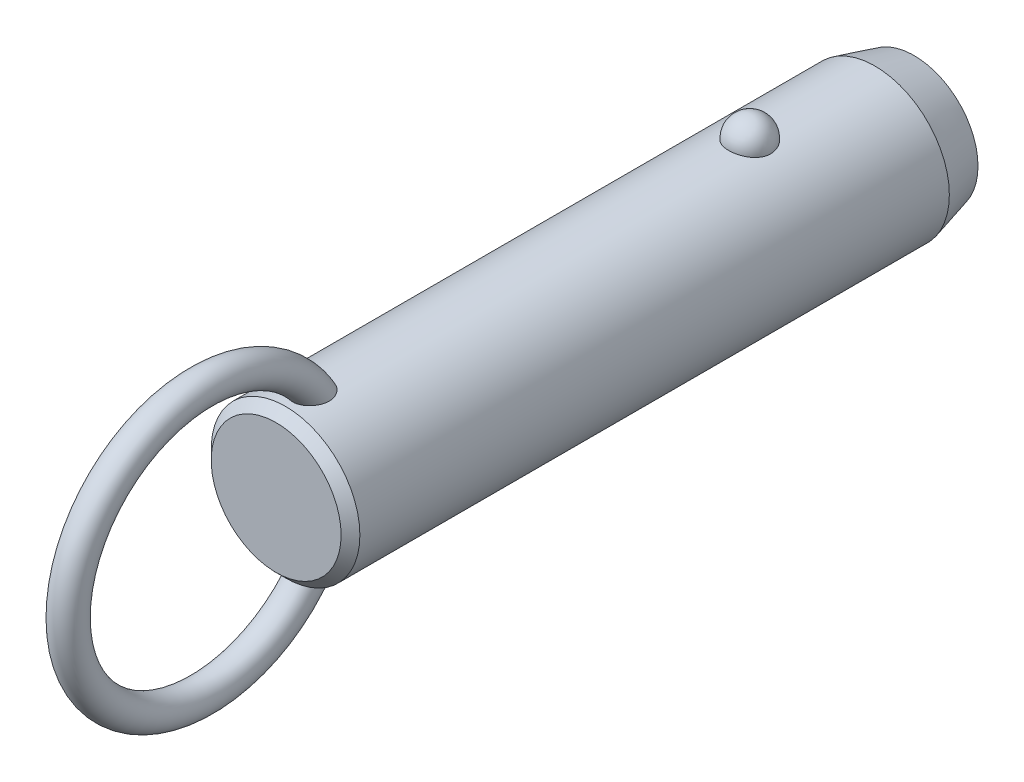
ISO-10303-21;
HEADER;
FILE_DESCRIPTION(('STEP AP214'),'2;1');
FILE_NAME('part.step','',(''),(''),'','','');
FILE_SCHEMA(('AUTOMOTIVE_DESIGN { 1 0 10303 214 1 1 1 1 }'));
ENDSEC;
DATA;
#1=APPLICATION_CONTEXT('core data for automotive mechanical design processes');
#2=APPLICATION_PROTOCOL_DEFINITION('international standard','automotive_design',2000,#1);
#3=PRODUCT_CONTEXT('',#1,'mechanical');
#4=PRODUCT('Part','Part','',(#3));
#5=PRODUCT_RELATED_PRODUCT_CATEGORY('part','',(#4));
#6=PRODUCT_DEFINITION_FORMATION('','',#4);
#7=PRODUCT_DEFINITION_CONTEXT('part definition',#1,'design');
#8=PRODUCT_DEFINITION('design','',#6,#7);
#9=PRODUCT_DEFINITION_SHAPE('','',#8);
#10=(LENGTH_UNIT() NAMED_UNIT(*) SI_UNIT(.MILLI.,.METRE.));
#11=(NAMED_UNIT(*) PLANE_ANGLE_UNIT() SI_UNIT($,.RADIAN.));
#12=(NAMED_UNIT(*) SI_UNIT($,.STERADIAN.) SOLID_ANGLE_UNIT());
#13=UNCERTAINTY_MEASURE_WITH_UNIT(LENGTH_MEASURE(1.E-05),#10,'distance_accuracy_value','');
#14=(GEOMETRIC_REPRESENTATION_CONTEXT(3) GLOBAL_UNCERTAINTY_ASSIGNED_CONTEXT((#13)) GLOBAL_UNIT_ASSIGNED_CONTEXT((#10,
#11,#12)) REPRESENTATION_CONTEXT('',''));
#15=CARTESIAN_POINT('',(0.,0.,0.));
#16=DIRECTION('',(0.,0.,1.));
#17=DIRECTION('',(1.,0.,0.));
#18=AXIS2_PLACEMENT_3D('',#15,#16,#17);
#19=CARTESIAN_POINT('',(0.,0.,48.3));
#20=DIRECTION('',(0.,0.,-1.));
#21=DIRECTION('',(-1.,0.,0.));
#22=AXIS2_PLACEMENT_3D('',#19,#20,#21);
#23=CYLINDRICAL_SURFACE('',#22,9.5);
#24=CARTESIAN_POINT('',(2.67259918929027,9.11631578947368,-2.7));
#25=CARTESIAN_POINT('',(2.6725968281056,9.11631786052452,-2.54909854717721));
#26=CARTESIAN_POINT('',(2.66030567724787,9.11994722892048,-2.39816735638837));
#27=CARTESIAN_POINT('',(2.6114347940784,9.13405924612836,-2.10058568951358));
#28=CARTESIAN_POINT('',(2.57484658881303,9.14454428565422,-1.95393672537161));
#29=CARTESIAN_POINT('',(2.47830875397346,9.17117631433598,-1.66916069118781));
#30=CARTESIAN_POINT('',(2.41836936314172,9.18732082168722,-1.53102991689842));
#31=CARTESIAN_POINT('',(2.27661331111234,9.22346780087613,-1.26705393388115));
#32=CARTESIAN_POINT('',(2.19479699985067,9.24347021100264,-1.14120852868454));
#33=CARTESIAN_POINT('',(2.01085282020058,9.28522401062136,-0.904632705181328));
#34=CARTESIAN_POINT('',(1.90862396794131,9.30698376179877,-0.793982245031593));
#35=CARTESIAN_POINT('',(1.6867437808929,9.34973971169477,-0.591607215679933));
#36=CARTESIAN_POINT('',(1.56709244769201,9.37073591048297,-0.49988264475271));
#37=CARTESIAN_POINT('',(1.31393976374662,9.40956370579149,-0.338167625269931));
#38=CARTESIAN_POINT('',(1.18048026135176,9.42740444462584,-0.268113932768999));
#39=CARTESIAN_POINT('',(0.903154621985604,9.45799906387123,-0.151390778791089));
#40=CARTESIAN_POINT('',(0.759289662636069,9.47075351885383,-0.104718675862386));
#41=CARTESIAN_POINT('',(0.468074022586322,9.48956256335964,-0.0367633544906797));
#42=CARTESIAN_POINT('',(0.320836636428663,9.49573643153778,-0.015027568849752));
#43=CARTESIAN_POINT('',(0.0246714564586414,9.50112183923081,0.00396199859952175));
#44=CARTESIAN_POINT('',(-0.124256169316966,9.50033406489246,0.00121819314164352));
#45=CARTESIAN_POINT('',(-0.417264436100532,9.4919475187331,-0.0284441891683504));
#46=CARTESIAN_POINT('',(-0.56138413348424,9.48444885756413,-0.0550074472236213));
#47=CARTESIAN_POINT('',(-0.842986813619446,9.46357853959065,-0.131064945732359));
#48=CARTESIAN_POINT('',(-0.980469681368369,9.450206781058,-0.180559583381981));
#49=CARTESIAN_POINT('',(-1.24585005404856,9.41890822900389,-0.301476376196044));
#50=CARTESIAN_POINT('',(-1.37368611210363,9.40095498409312,-0.373026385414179));
#51=CARTESIAN_POINT('',(-1.61552738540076,9.3624296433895,-0.536025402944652));
#52=CARTESIAN_POINT('',(-1.72953116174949,9.34185727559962,-0.627476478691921));
#53=CARTESIAN_POINT('',(-1.9429225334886,9.29984568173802,-0.829844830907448));
#54=CARTESIAN_POINT('',(-2.04198021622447,9.27839736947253,-0.941108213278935));
#55=CARTESIAN_POINT('',(-2.2202646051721,9.23735994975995,-1.17883414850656));
#56=CARTESIAN_POINT('',(-2.29948985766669,9.21777097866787,-1.30529781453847));
#57=CARTESIAN_POINT('',(-2.43697287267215,9.18238994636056,-1.57158566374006));
#58=CARTESIAN_POINT('',(-2.49497068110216,9.16664569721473,-1.71155057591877));
#59=CARTESIAN_POINT('',(-2.5872073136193,9.14104303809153,-1.99961197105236));
#60=CARTESIAN_POINT('',(-2.62144683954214,9.13118445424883,-2.14770821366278));
#61=CARTESIAN_POINT('',(-2.66521466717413,9.11850622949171,-2.44715424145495));
#62=CARTESIAN_POINT('',(-2.67484831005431,9.11565658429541,-2.59848735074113));
#63=CARTESIAN_POINT('',(-2.66946735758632,9.11723375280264,-2.90067317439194));
#64=CARTESIAN_POINT('',(-2.65445345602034,9.12166036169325,-3.05152590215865));
#65=CARTESIAN_POINT('',(-2.60029711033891,9.13724422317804,-3.34766110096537));
#66=CARTESIAN_POINT('',(-2.56127978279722,9.14836656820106,-3.49296833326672));
#67=CARTESIAN_POINT('',(-2.46018844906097,9.17606676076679,-3.77477535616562));
#68=CARTESIAN_POINT('',(-2.39811349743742,9.1926448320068,-3.9112747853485));
#69=CARTESIAN_POINT('',(-2.25202303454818,9.22952198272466,-4.17244273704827));
#70=CARTESIAN_POINT('',(-2.16788714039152,9.24984129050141,-4.29704106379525));
#71=CARTESIAN_POINT('',(-1.9799408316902,9.29188255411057,-4.53013066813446));
#72=CARTESIAN_POINT('',(-1.87612963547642,9.31360456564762,-4.63862130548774));
#73=CARTESIAN_POINT('',(-1.65105429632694,9.35612959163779,-4.8369029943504));
#74=CARTESIAN_POINT('',(-1.52972405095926,9.37692871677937,-4.92661991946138));
#75=CARTESIAN_POINT('',(-1.27318250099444,9.41518970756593,-5.08429106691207));
#76=CARTESIAN_POINT('',(-1.13797219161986,9.432651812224,-5.15224684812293));
#77=CARTESIAN_POINT('',(-0.859280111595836,9.46208255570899,-5.26371827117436));
#78=CARTESIAN_POINT('',(-0.715925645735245,9.47411833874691,-5.30753421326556));
#79=CARTESIAN_POINT('',(-0.423550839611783,9.4916822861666,-5.37076321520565));
#80=CARTESIAN_POINT('',(-0.274531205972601,9.49721125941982,-5.39017930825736));
#81=CARTESIAN_POINT('',(0.0218446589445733,9.50110860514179,-5.40390587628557));
#82=CARTESIAN_POINT('',(0.169177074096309,9.49961381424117,-5.39869609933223));
#83=CARTESIAN_POINT('',(0.460808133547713,9.48993906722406,-5.36441955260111));
#84=CARTESIAN_POINT('',(0.605106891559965,9.48175936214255,-5.33535367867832));
#85=CARTESIAN_POINT('',(0.886027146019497,9.4596376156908,-5.25435587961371));
#86=CARTESIAN_POINT('',(1.02267710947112,9.44571881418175,-5.20251612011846));
#87=CARTESIAN_POINT('',(1.28523827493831,9.41358993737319,-5.07741549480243));
#88=CARTESIAN_POINT('',(1.41114877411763,9.39537958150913,-5.00415322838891));
#89=CARTESIAN_POINT('',(1.65085227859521,9.3562644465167,-4.83684599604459));
#90=CARTESIAN_POINT('',(1.76442346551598,9.33532178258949,-4.74249218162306));
#91=CARTESIAN_POINT('',(1.97425672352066,9.29321198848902,-4.53620389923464));
#92=CARTESIAN_POINT('',(2.07051582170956,9.27204482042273,-4.42426641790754));
#93=CARTESIAN_POINT('',(2.24490086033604,9.23139221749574,-4.18363183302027));
#94=CARTESIAN_POINT('',(2.32267019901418,9.21194380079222,-4.05466990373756));
#95=CARTESIAN_POINT('',(2.45584092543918,9.1773419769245,-3.78517836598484));
#96=CARTESIAN_POINT('',(2.5112497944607,9.16218713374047,-3.64465264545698));
#97=CARTESIAN_POINT('',(2.59380876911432,9.13913522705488,-3.37104301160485));
#98=CARTESIAN_POINT('',(2.62330266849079,9.13064624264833,-3.23871053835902));
#99=CARTESIAN_POINT('',(2.66269870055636,9.11923566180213,-2.97092664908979));
#100=CARTESIAN_POINT('',(2.67260130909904,9.11631393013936,-2.83547530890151));
#101=CARTESIAN_POINT('',(2.67259918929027,9.11631578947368,-2.7));
#102=B_SPLINE_CURVE_WITH_KNOTS('',3,(#24,#25,#26,#27,#28,#29,#30,#31,#32,#33,#34,#35,#36,#37,
#38,#39,#40,#41,#42,#43,#44,#45,#46,#47,#48,#49,#50,#51,#52,#53,#54,#55,#56,#57,#58,#59,#60,#61,
#62,#63,#64,#65,#66,#67,#68,#69,#70,#71,#72,#73,#74,#75,#76,#77,#78,#79,#80,#81,#82,#83,#84,#85,
#86,#87,#88,#89,#90,#91,#92,#93,#94,#95,#96,#97,#98,#99,#100,#101),.UNSPECIFIED.,.T.,.F.,(4,2,2,
2,2,2,2,2,2,2,2,2,2,2,2,2,2,2,2,2,2,2,2,2,2,2,2,2,2,2,2,2,2,2,2,2,2,2,4),(0.,0.452217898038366,
0.904593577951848,1.35677112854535,1.80894144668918,2.26340676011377,2.71787203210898,
3.17099820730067,3.62407318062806,4.0687883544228,4.51345969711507,4.95160616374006,
5.38976021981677,5.83050358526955,6.27129275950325,6.72071308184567,7.17016633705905,
7.62495278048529,8.07972578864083,8.53254856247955,8.98535859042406,9.43582813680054,
9.88631615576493,10.3393155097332,10.7923328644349,11.2471065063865,11.7018475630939,
12.150795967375,12.599688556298,13.0398725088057,13.4800399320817,13.9184421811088,
14.3568730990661,14.802202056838,15.2476074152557,15.7010097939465,16.1542603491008,
16.5602594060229,16.966248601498),.UNSPECIFIED.);
#103=CARTESIAN_POINT('',(2.67259918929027,9.11631578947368,-2.7));
#104=VERTEX_POINT('',#103);
#105=EDGE_CURVE('E41',#104,#104,#102,.T.);
#106=ORIENTED_EDGE('',*,*,#105,.T.);
#107=EDGE_LOOP('',(#106));
#108=FACE_BOUND('',#107,.T.);
#109=CARTESIAN_POINT('',(0.,0.,56.62));
#110=DIRECTION('',(0.,0.,1.));
#111=DIRECTION('',(1.,0.,0.));
#112=AXIS2_PLACEMENT_3D('',#109,#110,#111);
#113=CIRCLE('',#112,9.5);
#114=CARTESIAN_POINT('',(9.5,0.,56.62));
#115=VERTEX_POINT('',#114);
#116=EDGE_CURVE('E10',#115,#115,#113,.F.);
#117=ORIENTED_EDGE('',*,*,#116,.T.);
#118=EDGE_LOOP('',(#117));
#119=FACE_BOUND('',#118,.T.);
#120=CARTESIAN_POINT('',(-0.697062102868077,-9.47439269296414,50.9678088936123));
#121=CARTESIAN_POINT('',(-0.799579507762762,-9.46685146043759,51.0074823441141));
#122=CARTESIAN_POINT('',(-0.898575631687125,-9.45788043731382,51.0559309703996));
#123=CARTESIAN_POINT('',(-1.08670047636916,-9.43811593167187,51.1688685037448));
#124=CARTESIAN_POINT('',(-1.17583204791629,-9.42732297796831,51.2333527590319));
#125=CARTESIAN_POINT('',(-1.34179806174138,-9.40513672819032,51.3762099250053));
#126=CARTESIAN_POINT('',(-1.41865133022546,-9.39374438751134,51.454561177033));
#127=CARTESIAN_POINT('',(-1.5586004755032,-9.37154196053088,51.6227524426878));
#128=CARTESIAN_POINT('',(-1.62169476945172,-9.3607319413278,51.7125937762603));
#129=CARTESIAN_POINT('',(-1.73527695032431,-9.34035749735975,51.9045001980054));
#130=CARTESIAN_POINT('',(-1.7852226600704,-9.33085270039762,52.0068910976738));
#131=CARTESIAN_POINT('',(-1.86924997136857,-9.3143834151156,52.218148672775));
#132=CARTESIAN_POINT('',(-1.90332570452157,-9.30741986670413,52.3270177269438));
#133=CARTESIAN_POINT('',(-1.95893603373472,-9.29588482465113,52.5604730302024));
#134=CARTESIAN_POINT('',(-1.97872420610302,-9.29165182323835,52.6854890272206));
#135=CARTESIAN_POINT('',(-2.00062129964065,-9.28695978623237,52.9370805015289));
#136=CARTESIAN_POINT('',(-2.00272284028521,-9.28650232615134,53.063656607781));
#137=CARTESIAN_POINT('',(-1.98958876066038,-9.28932750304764,53.3368157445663));
#138=CARTESIAN_POINT('',(-1.97143366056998,-9.2932400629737,53.4832519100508));
#139=CARTESIAN_POINT('',(-1.91479925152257,-9.30507151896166,53.7720629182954));
#140=CARTESIAN_POINT('',(-1.87629122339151,-9.31299607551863,53.914431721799));
#141=CARTESIAN_POINT('',(-1.77225683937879,-9.33340232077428,54.2151725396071));
#142=CARTESIAN_POINT('',(-1.70334898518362,-9.34641636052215,54.3723691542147));
#143=CARTESIAN_POINT('',(-1.58111062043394,-9.36759153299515,54.5975171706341));
#144=CARTESIAN_POINT('',(-1.53721459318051,-9.37492619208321,54.6707968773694));
#145=CARTESIAN_POINT('',(-1.44302631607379,-9.38988566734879,54.8130740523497));
#146=CARTESIAN_POINT('',(-1.39273721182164,-9.39751033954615,54.8820736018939));
#147=CARTESIAN_POINT('',(-1.26775962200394,-9.41530678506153,55.0369832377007));
#148=CARTESIAN_POINT('',(-1.19052326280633,-9.42548108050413,55.1208712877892));
#149=CARTESIAN_POINT('',(-1.0242024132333,-9.44499825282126,55.2760086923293));
#150=CARTESIAN_POINT('',(-0.935139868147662,-9.45434261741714,55.3472808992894));
#151=CARTESIAN_POINT('',(-0.766610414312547,-9.46930670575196,55.4586955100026));
#152=CARTESIAN_POINT('',(-0.689439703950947,-9.47529223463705,55.5022354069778));
#153=CARTESIAN_POINT('',(-0.528942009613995,-9.48560294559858,55.5763133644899));
#154=CARTESIAN_POINT('',(-0.445620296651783,-9.48992953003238,55.6068624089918));
#155=CARTESIAN_POINT('',(-0.273901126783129,-9.49644161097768,55.6525792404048));
#156=CARTESIAN_POINT('',(-0.185465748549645,-9.49860811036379,55.66761059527));
#157=CARTESIAN_POINT('',(-0.00734541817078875,-9.5004135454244,55.6801494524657));
#158=CARTESIAN_POINT('',(0.0823387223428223,-9.50005405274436,55.6776678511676));
#159=CARTESIAN_POINT('',(0.247679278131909,-9.49708301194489,55.6569959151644));
#160=CARTESIAN_POINT('',(0.323620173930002,-9.49477609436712,55.6409300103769));
#161=CARTESIAN_POINT('',(0.471981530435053,-9.48855917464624,55.5971726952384));
#162=CARTESIAN_POINT('',(0.544400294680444,-9.48464840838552,55.5694757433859));
#163=CARTESIAN_POINT('',(0.708947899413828,-9.47398336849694,55.4928026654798));
#164=CARTESIAN_POINT('',(0.799149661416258,-9.46671310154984,55.4397745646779));
#165=CARTESIAN_POINT('',(0.969783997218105,-9.4507622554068,55.3199731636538));
#166=CARTESIAN_POINT('',(1.05019415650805,-9.44207854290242,55.2531692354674));
#167=CARTESIAN_POINT('',(1.23092343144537,-9.42051459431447,55.0807596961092));
#168=CARTESIAN_POINT('',(1.32652499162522,-9.40733378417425,54.9702619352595));
#169=CARTESIAN_POINT('',(1.49893121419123,-9.38140745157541,54.7355614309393));
#170=CARTESIAN_POINT('',(1.57571616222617,-9.36866239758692,54.6113445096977));
#171=CARTESIAN_POINT('',(1.71285426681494,-9.34457644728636,54.3493891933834));
#172=CARTESIAN_POINT('',(1.77266365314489,-9.33328726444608,54.2113623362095));
#173=CARTESIAN_POINT('',(1.87239208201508,-9.31379209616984,53.9280515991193));
#174=CARTESIAN_POINT('',(1.91230158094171,-9.3055875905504,53.782764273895));
#175=CARTESIAN_POINT('',(1.9760418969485,-9.29228394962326,53.4620281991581));
#176=CARTESIAN_POINT('',(1.99587438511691,-9.28797202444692,53.2857248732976));
#177=CARTESIAN_POINT('',(2.0029570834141,-9.28645519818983,52.9324146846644));
#178=CARTESIAN_POINT('',(1.99025930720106,-9.28923895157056,52.7554093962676));
#179=CARTESIAN_POINT('',(1.93735479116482,-9.30038134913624,52.4563381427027));
#180=CARTESIAN_POINT('',(1.90576827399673,-9.30697680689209,52.3326679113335));
#181=CARTESIAN_POINT('',(1.82287484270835,-9.32356855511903,52.0923297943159));
#182=CARTESIAN_POINT('',(1.77158213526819,-9.33356239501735,51.9756569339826));
#183=CARTESIAN_POINT('',(1.64885744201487,-9.35602275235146,51.7527061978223));
#184=CARTESIAN_POINT('',(1.57730995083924,-9.36850332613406,51.6464927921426));
#185=CARTESIAN_POINT('',(1.41543264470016,-9.39431873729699,51.4495530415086));
#186=CARTESIAN_POINT('',(1.32510883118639,-9.40765330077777,51.3588217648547));
#187=CARTESIAN_POINT('',(1.13846223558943,-9.43195720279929,51.2050334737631));
#188=CARTESIAN_POINT('',(1.04369890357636,-9.44302894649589,51.1400947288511));
#189=CARTESIAN_POINT('',(0.843965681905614,-9.46296805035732,51.0280388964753));
#190=CARTESIAN_POINT('',(0.739000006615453,-9.4718363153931,50.9809144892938));
#191=CARTESIAN_POINT('',(0.528175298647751,-9.48586140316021,50.9081173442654));
#192=CARTESIAN_POINT('',(0.422686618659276,-9.49119633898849,50.8814024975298));
#193=CARTESIAN_POINT('',(0.208590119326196,-9.49831365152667,50.8460137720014));
#194=CARTESIAN_POINT('',(0.0999817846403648,-9.500095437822,50.8373428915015));
#195=CARTESIAN_POINT('',(-0.12610480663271,-9.49988861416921,50.8383501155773));
#196=CARTESIAN_POINT('',(-0.243578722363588,-9.49757821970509,50.8495942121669));
#197=CARTESIAN_POINT('',(-0.474390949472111,-9.48885165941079,50.893167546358));
#198=CARTESIAN_POINT('',(-0.587729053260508,-9.48243528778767,50.9254978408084));
#199=CARTESIAN_POINT('',(-0.697062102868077,-9.47439269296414,50.9678088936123));
#200=B_SPLINE_CURVE_WITH_KNOTS('',3,(#120,#121,#122,#123,#124,#125,#126,#127,#128,#129,#130,
#131,#132,#133,#134,#135,#136,#137,#138,#139,#140,#141,#142,#143,#144,#145,#146,#147,#148,#149,
#150,#151,#152,#153,#154,#155,#156,#157,#158,#159,#160,#161,#162,#163,#164,#165,#166,#167,#168,
#169,#170,#171,#172,#173,#174,#175,#176,#177,#178,#179,#180,#181,#182,#183,#184,#185,#186,#187,
#188,#189,#190,#191,#192,#193,#194,#195,#196,#197,#198,#199),.UNSPECIFIED.,.T.,.F.,(4,2,2,2,2,2,
2,2,2,2,2,2,2,2,2,2,2,2,2,2,2,2,2,2,2,2,2,2,2,2,2,2,2,2,2,2,2,2,2,4),(0.,0.330119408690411,
0.660143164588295,0.989655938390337,1.31920659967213,1.66074728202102,2.00241415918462,
2.38088696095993,2.75951768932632,3.20065679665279,3.6424200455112,4.15620996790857,
4.41314162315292,4.66994734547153,5.01228664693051,5.35399933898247,5.61943037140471,
5.88463652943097,6.15215502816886,6.41950709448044,6.65144391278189,6.88349136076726,
7.19641200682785,7.51003602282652,7.94779711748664,8.38601491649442,8.83699707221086,
9.28819530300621,9.81778662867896,10.3465317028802,10.7284172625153,11.1100280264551,
11.4938603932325,11.8775702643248,12.2220189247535,12.5663259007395,12.8915939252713,
13.2169159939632,13.5689650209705,13.9210316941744),.UNSPECIFIED.);
#201=CARTESIAN_POINT('',(-0.697062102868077,-9.47439269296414,50.9678088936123));
#202=VERTEX_POINT('',#201);
#203=EDGE_CURVE('E59',#202,#202,#200,.T.);
#204=ORIENTED_EDGE('',*,*,#203,.T.);
#205=EDGE_LOOP('',(#204));
#206=FACE_BOUND('',#205,.T.);
#207=CARTESIAN_POINT('',(-0.697062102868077,9.47439269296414,50.9678088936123));
#208=CARTESIAN_POINT('',(-0.597792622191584,9.48169483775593,50.9293956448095));
#209=CARTESIAN_POINT('',(-0.495106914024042,9.48766580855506,50.8991682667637));
#210=CARTESIAN_POINT('',(-0.285876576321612,9.49627648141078,50.8560327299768));
#211=CARTESIAN_POINT('',(-0.179324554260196,9.49890941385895,50.8431597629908));
#212=CARTESIAN_POINT('',(0.0344157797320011,9.50053798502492,50.8351666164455));
#213=CARTESIAN_POINT('',(0.141603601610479,9.49953613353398,50.8400341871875));
#214=CARTESIAN_POINT('',(0.353563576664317,9.49401038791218,50.8673654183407));
#215=CARTESIAN_POINT('',(0.458336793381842,9.48948807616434,50.88982117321));
#216=CARTESIAN_POINT('',(0.662493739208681,9.4774236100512,50.9516719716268));
#217=CARTESIAN_POINT('',(0.761881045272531,9.46988348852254,50.9910556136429));
#218=CARTESIAN_POINT('',(0.952608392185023,9.45260382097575,51.0856342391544));
#219=CARTESIAN_POINT('',(1.04394806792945,9.44286417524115,51.1408299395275));
#220=CARTESIAN_POINT('',(1.21712767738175,9.4221176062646,51.2660662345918));
#221=CARTESIAN_POINT('',(1.29885671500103,9.41109835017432,51.3362579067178));
#222=CARTESIAN_POINT('',(1.4497897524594,9.38903310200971,51.488980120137));
#223=CARTESIAN_POINT('',(1.51899278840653,9.37798710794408,51.5715116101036));
#224=CARTESIAN_POINT('',(1.64602857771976,9.35654375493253,51.7497763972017));
#225=CARTESIAN_POINT('',(1.70333052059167,9.34618688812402,51.8458916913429));
#226=CARTESIAN_POINT('',(1.80259341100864,9.32755128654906,52.045897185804));
#227=CARTESIAN_POINT('',(1.84454942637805,9.31927322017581,52.1497898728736));
#228=CARTESIAN_POINT('',(1.91637039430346,9.30478365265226,52.3722131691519));
#229=CARTESIAN_POINT('',(1.944805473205,9.29882552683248,52.4912192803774));
#230=CARTESIAN_POINT('',(1.98449865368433,9.29043398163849,52.7321436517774));
#231=CARTESIAN_POINT('',(1.99574908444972,9.28800213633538,52.8540631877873));
#232=CARTESIAN_POINT('',(2.00275141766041,9.28649645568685,53.1169324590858));
#233=CARTESIAN_POINT('',(1.99588238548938,9.28799035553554,53.2579529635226));
#234=CARTESIAN_POINT('',(1.96270559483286,9.29505517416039,53.5376217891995));
#235=CARTESIAN_POINT('',(1.93637872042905,9.30063010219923,53.676267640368));
#236=CARTESIAN_POINT('',(1.85949176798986,9.31633564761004,53.9725616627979));
#237=CARTESIAN_POINT('',(1.80549792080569,9.3270926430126,54.1292907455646));
#238=CARTESIAN_POINT('',(1.67376869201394,9.3516306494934,54.4322840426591));
#239=CARTESIAN_POINT('',(1.59603181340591,9.36541185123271,54.5785475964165));
#240=CARTESIAN_POINT('',(1.4360277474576,9.39110706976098,54.8258138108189));
#241=CARTESIAN_POINT('',(1.35831795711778,9.40278656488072,54.929791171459));
#242=CARTESIAN_POINT('',(1.18774483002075,9.42585025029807,55.1245347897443));
#243=CARTESIAN_POINT('',(1.09490932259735,9.43723493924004,55.2153247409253));
#244=CARTESIAN_POINT('',(0.921110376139,9.45552616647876,55.3562033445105));
#245=CARTESIAN_POINT('',(0.843738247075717,9.46281058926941,55.4106563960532));
#246=CARTESIAN_POINT('',(0.681245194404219,9.47589120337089,55.5067117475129));
#247=CARTESIAN_POINT('',(0.596135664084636,9.48168953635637,55.5483325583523));
#248=CARTESIAN_POINT('',(0.433779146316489,9.49038144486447,55.6100899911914));
#249=CARTESIAN_POINT('',(0.357459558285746,9.49359170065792,55.6326013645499));
#250=CARTESIAN_POINT('',(0.202074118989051,9.49816761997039,55.6645745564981));
#251=CARTESIAN_POINT('',(0.12301025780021,9.49953459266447,55.6740456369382));
#252=CARTESIAN_POINT('',(-0.0357372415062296,9.50026497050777,55.6791143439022));
#253=CARTESIAN_POINT('',(-0.115421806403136,9.49962433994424,55.6746840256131));
#254=CARTESIAN_POINT('',(-0.272823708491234,9.49640854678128,55.6522962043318));
#255=CARTESIAN_POINT('',(-0.350540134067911,9.4938325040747,55.6343325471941));
#256=CARTESIAN_POINT('',(-0.500580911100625,9.4870946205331,55.5868028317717));
#257=CARTESIAN_POINT('',(-0.57297929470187,9.48296359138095,55.5574618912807));
#258=CARTESIAN_POINT('',(-0.712864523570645,9.47347609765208,55.4890087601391));
#259=CARTESIAN_POINT('',(-0.7803490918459,9.46811906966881,55.4498920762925));
#260=CARTESIAN_POINT('',(-0.946309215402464,9.45329720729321,55.339432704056));
#261=CARTESIAN_POINT('',(-1.04090230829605,9.44321512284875,55.2623297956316));
#262=CARTESIAN_POINT('',(-1.21661929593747,9.42219227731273,55.0940971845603));
#263=CARTESIAN_POINT('',(-1.29770519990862,9.41124921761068,55.0029292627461));
#264=CARTESIAN_POINT('',(-1.4731964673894,9.38563439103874,54.7761621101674));
#265=CARTESIAN_POINT('',(-1.56208878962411,9.37102009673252,54.6362895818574));
#266=CARTESIAN_POINT('',(-1.71623987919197,9.34401559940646,54.3439503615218));
#267=CARTESIAN_POINT('',(-1.7814786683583,9.33162728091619,54.1914731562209));
#268=CARTESIAN_POINT('',(-1.88853837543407,9.31055541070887,53.8756470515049));
#269=CARTESIAN_POINT('',(-1.9299899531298,9.30193076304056,53.7121685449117));
#270=CARTESIAN_POINT('',(-1.98590726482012,9.29015757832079,53.3805268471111));
#271=CARTESIAN_POINT('',(-2.00040705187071,9.2870021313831,53.2123698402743));
#272=CARTESIAN_POINT('',(-1.99964701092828,9.28716218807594,52.9050806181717));
#273=CARTESIAN_POINT('',(-1.98908145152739,9.28945704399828,52.7659362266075));
#274=CARTESIAN_POINT('',(-1.94566294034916,9.29865169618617,52.4911539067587));
#275=CARTESIAN_POINT('',(-1.91282062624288,9.30554929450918,52.355514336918));
#276=CARTESIAN_POINT('',(-1.84582133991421,9.31898248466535,52.1578026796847));
#277=CARTESIAN_POINT('',(-1.82038084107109,9.32400364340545,52.0925830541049));
#278=CARTESIAN_POINT('',(-1.76350511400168,9.33492884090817,51.9649033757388));
#279=CARTESIAN_POINT('',(-1.73207305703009,9.3408324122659,51.9024418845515));
#280=CARTESIAN_POINT('',(-1.66324243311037,9.353333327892,51.7809407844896));
#281=CARTESIAN_POINT('',(-1.62584239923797,9.35993084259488,51.7219020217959));
#282=CARTESIAN_POINT('',(-1.545276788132,9.37356864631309,51.6079875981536));
#283=CARTESIAN_POINT('',(-1.50211241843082,9.38060884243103,51.5531110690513));
#284=CARTESIAN_POINT('',(-1.37681147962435,9.40004442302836,51.4099619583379));
#285=CARTESIAN_POINT('',(-1.2891635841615,9.41261047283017,51.3264295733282));
#286=CARTESIAN_POINT('',(-1.09996826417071,9.43658180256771,51.1772360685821));
#287=CARTESIAN_POINT('',(-0.998461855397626,9.44799034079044,51.1115238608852));
#288=CARTESIAN_POINT('',(-0.860188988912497,9.46103017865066,51.0394367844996));
#289=CARTESIAN_POINT('',(-0.828141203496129,9.46389141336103,51.0238511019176));
#290=CARTESIAN_POINT('',(-0.763210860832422,9.46934915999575,50.9944734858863));
#291=CARTESIAN_POINT('',(-0.730328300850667,9.47194567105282,50.9806815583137));
#292=CARTESIAN_POINT('',(-0.697062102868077,9.47439269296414,50.9678088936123));
#293=B_SPLINE_CURVE_WITH_KNOTS('',3,(#207,#208,#209,#210,#211,#212,#213,#214,#215,#216,#217,
#218,#219,#220,#221,#222,#223,#224,#225,#226,#227,#228,#229,#230,#231,#232,#233,#234,#235,#236,
#237,#238,#239,#240,#241,#242,#243,#244,#245,#246,#247,#248,#249,#250,#251,#252,#253,#254,#255,
#256,#257,#258,#259,#260,#261,#262,#263,#264,#265,#266,#267,#268,#269,#270,#271,#272,#273,#274,
#275,#276,#277,#278,#279,#280,#281,#282,#283,#284,#285,#286,#287,#288,#289,#290,#291,#292),
.UNSPECIFIED.,.T.,.F.,(4,2,2,2,2,2,2,2,2,2,2,2,2,2,2,2,2,2,2,2,2,2,2,2,2,2,2,2,2,2,2,2,2,2,2,2,
2,2,2,2,2,2,4),(0.,0.319942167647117,0.640532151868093,0.96090081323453,1.28112555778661,
1.60113495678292,1.92115886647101,2.24457323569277,2.56801248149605,2.90371927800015,
3.23953387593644,3.60560313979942,3.97183576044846,4.39383693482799,4.81625324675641,
5.31257045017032,5.80891895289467,6.19868344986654,6.58773876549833,6.87145417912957,
7.15475838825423,7.3926375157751,7.63034760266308,7.86853584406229,8.10683246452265,
8.3406366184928,8.57454843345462,8.93983939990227,9.30614105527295,9.80266668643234,
10.2996107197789,10.8040753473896,11.3079021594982,11.7249776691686,12.1418541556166,
12.3521485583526,12.562331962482,12.7725671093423,12.9827582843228,13.3458276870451,
13.7078449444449,13.8150604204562,13.9222762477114),.UNSPECIFIED.);
#294=CARTESIAN_POINT('',(-0.697062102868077,9.47439269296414,50.9678088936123));
#295=VERTEX_POINT('',#294);
#296=EDGE_CURVE('E67',#295,#295,#293,.T.);
#297=ORIENTED_EDGE('',*,*,#296,.T.);
#298=EDGE_LOOP('',(#297));
#299=FACE_BOUND('',#298,.T.);
#300=CARTESIAN_POINT('',(0.,0.,-18.7));
#301=DIRECTION('',(0.,0.,-1.));
#302=DIRECTION('',(-1.,0.,0.));
#303=AXIS2_PLACEMENT_3D('',#300,#301,#302);
#304=CIRCLE('',#303,9.5);
#305=CARTESIAN_POINT('',(9.50000000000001,0.,-18.7));
#306=VERTEX_POINT('',#305);
#307=EDGE_CURVE('E56',#306,#306,#304,.F.);
#308=ORIENTED_EDGE('',*,*,#307,.T.);
#309=EDGE_LOOP('',(#308));
#310=FACE_BOUND('',#309,.T.);
#311=ADVANCED_FACE('F37',(#108,#119,#206,#299,#310),#23,.T.);
#312=CARTESIAN_POINT('',(0.,0.,-23.7));
#313=DIRECTION('',(0.,0.,-1.));
#314=DIRECTION('',(-1.,0.,0.));
#315=AXIS2_PLACEMENT_3D('',#312,#313,#314);
#316=PLANE('',#315);
#317=CARTESIAN_POINT('',(0.,0.,-23.7));
#318=DIRECTION('',(0.,0.,-1.));
#319=DIRECTION('',(-1.,0.,0.));
#320=AXIS2_PLACEMENT_3D('',#317,#318,#319);
#321=CIRCLE('',#320,8.16025403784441);
#322=CARTESIAN_POINT('',(8.16025403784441,0.,-23.7));
#323=VERTEX_POINT('',#322);
#324=EDGE_CURVE('E66',#323,#323,#321,.T.);
#325=ORIENTED_EDGE('',*,*,#324,.T.);
#326=EDGE_LOOP('',(#325));
#327=FACE_BOUND('',#326,.T.);
#328=ADVANCED_FACE('F85',(#327),#316,.T.);
#329=CARTESIAN_POINT('',(0.,0.,-23.7));
#330=DIRECTION('',(0.,0.,1.));
#331=DIRECTION('',(1.,0.,0.));
#332=AXIS2_PLACEMENT_3D('',#329,#330,#331);
#333=CONICAL_SURFACE('',#332,8.16025403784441,0.261799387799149);
#334=CARTESIAN_POINT('',(9.50000000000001,0.,-18.7));
#335=CARTESIAN_POINT('',(9.48604431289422,0.,-18.7520833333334));
#336=CARTESIAN_POINT('',(9.47208862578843,0.,-18.8041666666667));
#337=CARTESIAN_POINT('',(9.44417725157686,0.,-18.9083333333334));
#338=CARTESIAN_POINT('',(9.43022156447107,0.,-18.9604166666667));
#339=CARTESIAN_POINT('',(9.40231019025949,0.,-19.0645833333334));
#340=CARTESIAN_POINT('',(9.38835450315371,0.,-19.1166666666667));
#341=CARTESIAN_POINT('',(9.36044312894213,0.,-19.2208333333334));
#342=CARTESIAN_POINT('',(9.34648744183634,0.,-19.2729166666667));
#343=CARTESIAN_POINT('',(9.31857606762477,0.,-19.3770833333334));
#344=CARTESIAN_POINT('',(9.30462038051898,0.,-19.4291666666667));
#345=CARTESIAN_POINT('',(9.2767090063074,0.,-19.5333333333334));
#346=CARTESIAN_POINT('',(9.26275331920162,0.,-19.5854166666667));
#347=CARTESIAN_POINT('',(9.23484194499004,0.,-19.6895833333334));
#348=CARTESIAN_POINT('',(9.22088625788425,0.,-19.7416666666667));
#349=CARTESIAN_POINT('',(9.19297488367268,0.,-19.8458333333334));
#350=CARTESIAN_POINT('',(9.17901919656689,0.,-19.8979166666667));
#351=CARTESIAN_POINT('',(9.15110782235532,0.,-20.0020833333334));
#352=CARTESIAN_POINT('',(9.13715213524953,0.,-20.0541666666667));
#353=CARTESIAN_POINT('',(9.10924076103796,0.,-20.1583333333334));
#354=CARTESIAN_POINT('',(9.09528507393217,0.,-20.2104166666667));
#355=CARTESIAN_POINT('',(9.06737369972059,0.,-20.3145833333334));
#356=CARTESIAN_POINT('',(9.05341801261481,0.,-20.3666666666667));
#357=CARTESIAN_POINT('',(9.02550663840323,0.,-20.4708333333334));
#358=CARTESIAN_POINT('',(9.01155095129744,0.,-20.5229166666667));
#359=CARTESIAN_POINT('',(8.98363957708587,0.,-20.6270833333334));
#360=CARTESIAN_POINT('',(8.96968388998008,0.,-20.6791666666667));
#361=CARTESIAN_POINT('',(8.94177251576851,0.,-20.7833333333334));
#362=CARTESIAN_POINT('',(8.92781682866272,0.,-20.8354166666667));
#363=CARTESIAN_POINT('',(8.89990545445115,0.,-20.9395833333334));
#364=CARTESIAN_POINT('',(8.88594976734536,0.,-20.9916666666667));
#365=CARTESIAN_POINT('',(8.85803839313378,0.,-21.0958333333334));
#366=CARTESIAN_POINT('',(8.84408270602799,0.,-21.1479166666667));
#367=CARTESIAN_POINT('',(8.81617133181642,0.,-21.2520833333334));
#368=CARTESIAN_POINT('',(8.80221564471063,0.,-21.3041666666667));
#369=CARTESIAN_POINT('',(8.77430427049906,0.,-21.4083333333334));
#370=CARTESIAN_POINT('',(8.76034858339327,0.,-21.4604166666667));
#371=CARTESIAN_POINT('',(8.7324372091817,0.,-21.5645833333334));
#372=CARTESIAN_POINT('',(8.71848152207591,0.,-21.6166666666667));
#373=CARTESIAN_POINT('',(8.69057014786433,0.,-21.7208333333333));
#374=CARTESIAN_POINT('',(8.67661446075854,0.,-21.7729166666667));
#375=CARTESIAN_POINT('',(8.64870308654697,0.,-21.8770833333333));
#376=CARTESIAN_POINT('',(8.63474739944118,0.,-21.9291666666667));
#377=CARTESIAN_POINT('',(8.60683602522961,0.,-22.0333333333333));
#378=CARTESIAN_POINT('',(8.59288033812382,0.,-22.0854166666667));
#379=CARTESIAN_POINT('',(8.56496896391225,0.,-22.1895833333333));
#380=CARTESIAN_POINT('',(8.55101327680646,0.,-22.2416666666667));
#381=CARTESIAN_POINT('',(8.52310190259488,0.,-22.3458333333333));
#382=CARTESIAN_POINT('',(8.5091462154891,0.,-22.3979166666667));
#383=CARTESIAN_POINT('',(8.48123484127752,0.,-22.5020833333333));
#384=CARTESIAN_POINT('',(8.46727915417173,0.,-22.5541666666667));
#385=CARTESIAN_POINT('',(8.43936777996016,0.,-22.6583333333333));
#386=CARTESIAN_POINT('',(8.42541209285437,0.,-22.7104166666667));
#387=CARTESIAN_POINT('',(8.3975007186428,0.,-22.8145833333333));
#388=CARTESIAN_POINT('',(8.38354503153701,0.,-22.8666666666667));
#389=CARTESIAN_POINT('',(8.35563365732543,0.,-22.9708333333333));
#390=CARTESIAN_POINT('',(8.34167797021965,0.,-23.0229166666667));
#391=CARTESIAN_POINT('',(8.31376659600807,0.,-23.1270833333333));
#392=CARTESIAN_POINT('',(8.29981090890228,0.,-23.1791666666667));
#393=CARTESIAN_POINT('',(8.27189953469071,0.,-23.2833333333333));
#394=CARTESIAN_POINT('',(8.25794384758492,0.,-23.3354166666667));
#395=CARTESIAN_POINT('',(8.23003247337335,0.,-23.4395833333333));
#396=CARTESIAN_POINT('',(8.21607678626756,0.,-23.4916666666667));
#397=CARTESIAN_POINT('',(8.18816541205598,0.,-23.5958333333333));
#398=CARTESIAN_POINT('',(8.1742097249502,0.,-23.6479166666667));
#399=CARTESIAN_POINT('',(8.16025403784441,0.,-23.7));
#400=B_SPLINE_CURVE_WITH_KNOTS('',3,(#334,#335,#336,#337,#338,#339,#340,#341,#342,#343,#344,
#345,#346,#347,#348,#349,#350,#351,#352,#353,#354,#355,#356,#357,#358,#359,#360,#361,#362,#363,
#364,#365,#366,#367,#368,#369,#370,#371,#372,#373,#374,#375,#376,#377,#378,#379,#380,#381,#382,
#383,#384,#385,#386,#387,#388,#389,#390,#391,#392,#393,#394,#395,#396,#397,#398,#399),
.UNSPECIFIED.,.F.,.F.,(4,2,2,2,2,2,2,2,2,2,2,2,2,2,2,2,2,2,2,2,2,2,2,2,2,2,2,2,2,2,2,2,4),(0.,
0.161761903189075,0.323523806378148,0.485285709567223,0.647047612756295,0.808809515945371,
0.970571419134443,1.13233332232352,1.29409522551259,1.45585712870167,1.61761903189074,
1.77938093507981,1.94114283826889,2.10290474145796,2.26466664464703,2.42642854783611,
2.58819045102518,2.74995235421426,2.91171425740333,3.0734761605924,3.23523806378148,
3.39699996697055,3.55876187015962,3.7205237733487,3.88228567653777,4.04404757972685,
4.20580948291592,4.36757138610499,4.52933328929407,4.69109519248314,4.85285709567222,
5.01461899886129,5.17638090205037),.UNSPECIFIED.);
#401=EDGE_CURVE('BSEAM83',#306,#323,#400,.T.);
#402=ORIENTED_EDGE('',*,*,#307,.F.);
#403=ORIENTED_EDGE('',*,*,#324,.F.);
#404=ORIENTED_EDGE('',*,*,#401,.T.);
#405=ORIENTED_EDGE('',*,*,#401,.F.);
#406=EDGE_LOOP('',(#402,#404,#403,#405));
#407=FACE_BOUND('',#406,.T.);
#408=ADVANCED_FACE('F83',(#407),#333,.T.);
#409=CARTESIAN_POINT('',(0.,0.,57.82));
#410=DIRECTION('',(0.,0.,1.));
#411=DIRECTION('',(1.,0.,0.));
#412=AXIS2_PLACEMENT_3D('',#409,#410,#411);
#413=PLANE('',#412);
#414=CARTESIAN_POINT('',(0.,0.,57.82));
#415=DIRECTION('',(0.,0.,1.));
#416=DIRECTION('',(1.,0.,0.));
#417=AXIS2_PLACEMENT_3D('',#414,#415,#416);
#418=CIRCLE('',#417,8.30000000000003);
#419=CARTESIAN_POINT('',(8.30000000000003,0.,57.82));
#420=VERTEX_POINT('',#419);
#421=EDGE_CURVE('E50',#420,#420,#418,.T.);
#422=ORIENTED_EDGE('',*,*,#421,.T.);
#423=EDGE_LOOP('',(#422));
#424=FACE_BOUND('',#423,.T.);
#425=ADVANCED_FACE('F77',(#424),#413,.T.);
#426=CARTESIAN_POINT('',(0.,0.,67.35));
#427=DIRECTION('',(1.,0.,0.));
#428=DIRECTION('',(0.,0.,-1.));
#429=AXIS2_PLACEMENT_3D('',#426,#427,#428);
#430=TOROIDAL_SURFACE('',#429,17.05,2.);
#431=ORIENTED_EDGE('',*,*,#296,.F.);
#432=EDGE_LOOP('',(#431));
#433=FACE_BOUND('',#432,.T.);
#434=ORIENTED_EDGE('',*,*,#203,.F.);
#435=EDGE_LOOP('',(#434));
#436=FACE_BOUND('',#435,.T.);
#437=ADVANCED_FACE('F73',(#433,#436),#430,.T.);
#438=CARTESIAN_POINT('',(0.,0.,57.82));
#439=DIRECTION('',(0.,0.,-1.));
#440=DIRECTION('',(-1.,0.,0.));
#441=AXIS2_PLACEMENT_3D('',#438,#439,#440);
#442=CONICAL_SURFACE('',#441,8.30000000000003,0.785398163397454);
#443=ORIENTED_EDGE('',*,*,#116,.F.);
#444=EDGE_LOOP('',(#443));
#445=FACE_BOUND('',#444,.T.);
#446=ORIENTED_EDGE('',*,*,#421,.F.);
#447=EDGE_LOOP('',(#446));
#448=FACE_BOUND('',#447,.T.);
#449=ADVANCED_FACE('F39',(#445,#448),#442,.T.);
#450=CARTESIAN_POINT('',(0.,9.5,-2.7));
#451=DIRECTION('',(0.,1.,0.));
#452=DIRECTION('',(0.,0.,-1.));
#453=AXIS2_PLACEMENT_3D('',#450,#451,#452);
#454=SPHERICAL_SURFACE('',#453,2.7);
#455=ORIENTED_EDGE('',*,*,#105,.F.);
#456=EDGE_LOOP('',(#455));
#457=FACE_BOUND('',#456,.T.);
#458=ADVANCED_FACE('F79',(#457),#454,.T.);
#459=CLOSED_SHELL('',(#311,#328,#408,#425,#437,#449,#458));
#460=MANIFOLD_SOLID_BREP('B2',#459);
#461=ADVANCED_BREP_SHAPE_REPRESENTATION('',(#18,#460),#14);
#462=SHAPE_DEFINITION_REPRESENTATION(#9,#461);
ENDSEC;
END-ISO-10303-21;
